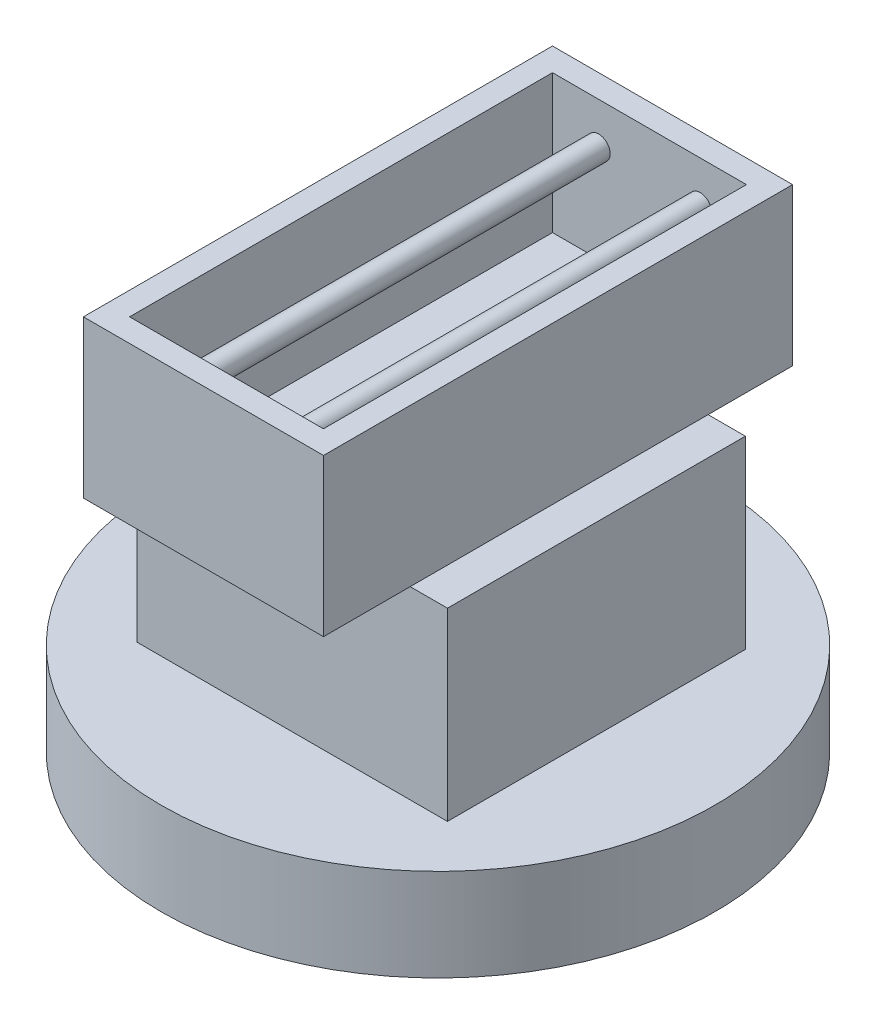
from build123d import *

# Parameters (mm, degrees)
SKETCH1_R          = 25
EXTRUDE1_DEPTH     = 20
SKETCH9_R          = 60
EXTRUDE5_DEPTH     = 20
SKETCH10_W         = 67.245526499
SKETCH10_H         = 64.528496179
EXTRUDE6_DEPTH     = 40
SKETCH12_W         = 52
SKETCH12_H         = 101.6
EXTRUDE7_DEPTH     = 34
SKETCH13_W         = 42
SKETCH13_H         = 91.6
CUT_EXTRUDE1_DEPTH = 30
EXTRUDE8_REACH     = 159.203
SKETCH14_R         = 2.5


with BuildPart() as part:
    # Sketch1 → Extrude1 (new body)
    with BuildSketch(Plane(origin=(0, 0, 0), x_dir=(1, 0, 0), z_dir=(0, 1, 0))):
        with Locations(Location((0, 0, 0), (0, 0, 270))):
            Circle(SKETCH1_R)
    extrude(amount=-EXTRUDE1_DEPTH)

    # Sketch9 → Extrude5 (add)
    with BuildSketch(Plane(origin=(0, 0, 0), x_dir=(-1, 0, 0), z_dir=(0, 1, 0))):
        with Locations(Location((0, 0, 0), (0, 0, 90))):
            Circle(SKETCH9_R)
    extrude(amount=EXTRUDE5_DEPTH)

    # Sketch10 → Extrude6 (add)
    with BuildSketch(Plane(origin=(0, 20, 0), x_dir=(-1, 0, 0), z_dir=(0, 1, 0))):
        with Locations((-0.451663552, -0.23862122)):
            Rectangle(SKETCH10_W, SKETCH10_H)
    extrude(amount=EXTRUDE6_DEPTH)

    # Sketch12 → Extrude7 (add)
    with BuildSketch(Plane(origin=(0, 60, 0), x_dir=(-1, 0, 0), z_dir=(0, 1, 0))):
        Rectangle(SKETCH12_W, SKETCH12_H)
    extrude(amount=EXTRUDE7_DEPTH)

    # Sketch13 → Cut-Extrude1 (cut)
    with BuildSketch(Plane(origin=(0, 94, 0), x_dir=(-1, 0, 0), z_dir=(0, 1, 0))):
        Rectangle(SKETCH13_W, SKETCH13_H)
    extrude(amount=-CUT_EXTRUDE1_DEPTH, mode=Mode.SUBTRACT)

    # Sketch14 → Extrude8 (add, up to next)
    with BuildSketch(Plane.XY.offset(50.8), mode=Mode.PRIVATE) as extrude8_sk1:
        with Locations((11, 85)):
            Circle(SKETCH14_R)
    extrude8_tool1 = extrude(extrude8_sk1.sketch, amount=-EXTRUDE8_REACH, mode=Mode.PRIVATE) - part.part
    # Sketch14 → Extrude8 (add, up to next)
    with BuildSketch(Plane.XY.offset(50.8), mode=Mode.PRIVATE) as extrude8_sk2:
        with Locations((-11, 85)):
            Circle(SKETCH14_R)
    extrude8_tool2 = extrude(extrude8_sk2.sketch, amount=-EXTRUDE8_REACH, mode=Mode.PRIVATE) - part.part
    add(extrude8_tool1.solids().sort_by_distance((11, 85, 50.8))[0])
    add(extrude8_tool2.solids().sort_by_distance((-11, 85, 50.8))[0])


solid = part.part
